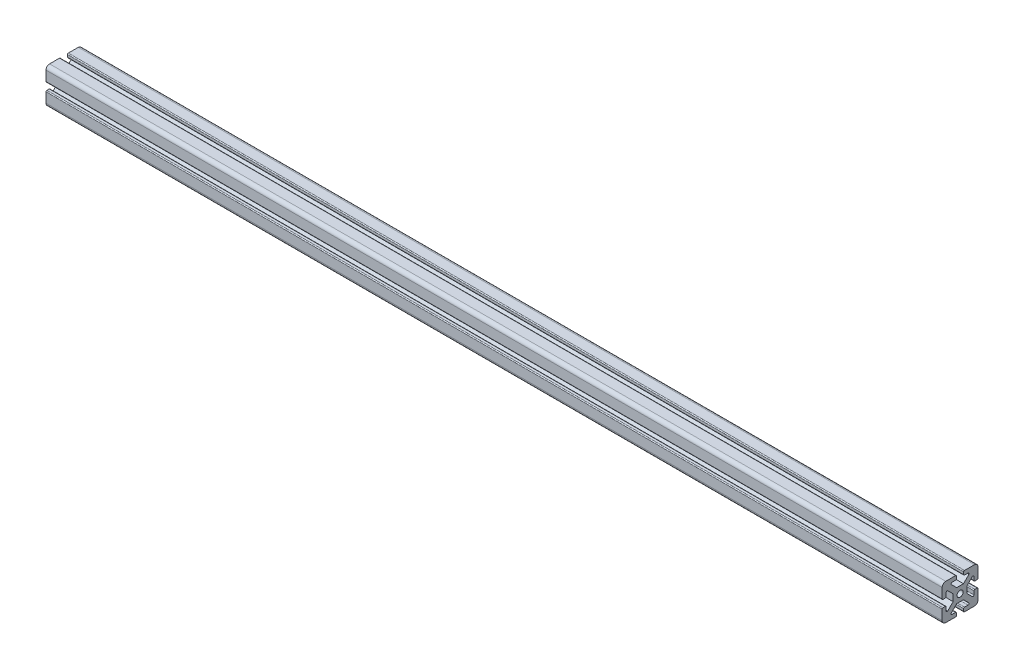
from build123d import *

# Parameters (mm, degrees)
MODEL_R                = 3.4
STRUKTURBAUTEIL1_DEPTH = 1000


with BuildPart() as part:
    # Model → Strukturbauteil1 (new body)
    with BuildSketch(Plane(origin=(0, 0, 0), x_dir=(0, 0, -1), z_dir=(1, 0, 0))):
        with BuildLine():
            Line((-18.5, -4), (-16.5, -4))
            ThreePointArc((-16.5, -4), (-15.792893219, -4.292893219), (-15.5, -5))
            Line((-15.5, -5), (-15.5, -8.91611505))
            ThreePointArc((-15.5, -8.91611505), (-14.905025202, -9.883468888), (-13.773297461, -9.788807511))
            Line((-13.773297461, -9.788807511), (-7.75, -3.793502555))
            Line((-7.75, -3.793502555), (-7.75, 3.793502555))
            Line((-7.75, 3.793502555), (-13.773297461, 9.788807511))
            ThreePointArc((-13.773297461, 9.788807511), (-14.905025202, 9.883468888), (-15.5, 8.91611505))
            Line((-15.5, 8.91611505), (-15.5, 5))
            ThreePointArc((-15.5, 5), (-15.792893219, 4.292893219), (-16.5, 4))
            Line((-16.5, 4), (-18.5, 4))
            Line((-18.5, 4), (-19, 4))
            ThreePointArc((-19, 4), (-19.707106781, 4.292893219), (-20, 5))
            Line((-20, 5), (-20, 16))
            ThreePointArc((-20, 16), (-18.828427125, 18.828427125), (-16, 20))
            Line((-16, 20), (-5.5, 20))
            Line((-5.5, 20), (-5, 20))
            ThreePointArc((-5, 20), (-4.292893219, 19.707106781), (-4, 19))
            Line((-4, 19), (-4, 18.5))
            Line((-4, 18.5), (-4, 16.5))
            ThreePointArc((-4, 16.5), (-4.292893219, 15.792893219), (-5, 15.5))
            Line((-5, 15.5), (-8.91611505, 15.5))
            ThreePointArc((-8.91611505, 15.5), (-9.883468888, 14.905025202), (-9.788807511, 13.773297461))
            Line((-9.788807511, 13.773297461), (-3.793502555, 7.75))
            Line((-3.793502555, 7.75), (3.793502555, 7.75))
            Line((3.793502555, 7.75), (9.788807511, 13.773297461))
            ThreePointArc((9.788807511, 13.773297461), (9.883468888, 14.905025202), (8.91611505, 15.5))
            Line((8.91611505, 15.5), (5, 15.5))
            ThreePointArc((5, 15.5), (4.292893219, 15.792893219), (4, 16.5))
            Line((4, 16.5), (4, 18.5))
            Line((4, 18.5), (4, 19))
            ThreePointArc((4, 19), (4.292893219, 19.707106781), (5, 20))
            Line((5, 20), (5.5, 20))
            Line((5.5, 20), (16, 20))
            ThreePointArc((16, 20), (18.828427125, 18.828427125), (20, 16))
            Line((20, 16), (20, 5.5))
            Line((20, 5.5), (20, 5))
            ThreePointArc((20, 5), (19.707106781, 4.292893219), (19, 4))
            Line((19, 4), (18.5, 4))
            Line((18.5, 4), (16.5, 4))
            ThreePointArc((16.5, 4), (15.792893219, 4.292893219), (15.5, 5))
            Line((15.5, 5), (15.5, 8.91611505))
            ThreePointArc((15.5, 8.91611505), (14.905025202, 9.883468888), (13.773297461, 9.788807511))
            Line((13.773297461, 9.788807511), (7.75, 3.793502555))
            Line((7.75, 3.793502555), (7.75, -3.793502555))
            Line((7.75, -3.793502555), (13.773297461, -9.788807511))
            ThreePointArc((13.773297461, -9.788807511), (14.905025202, -9.883468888), (15.5, -8.91611505))
            Line((15.5, -8.91611505), (15.5, -5))
            ThreePointArc((15.5, -5), (15.792893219, -4.292893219), (16.5, -4))
            Line((16.5, -4), (18.5, -4))
            Line((18.5, -4), (19, -4))
            ThreePointArc((19, -4), (19.707106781, -4.292893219), (20, -5))
            Line((20, -5), (20, -5.5))
            Line((20, -5.5), (20, -16))
            ThreePointArc((20, -16), (18.828427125, -18.828427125), (16, -20))
            Line((16, -20), (5.5, -20))
            Line((5.5, -20), (5, -20))
            ThreePointArc((5, -20), (4.292893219, -19.707106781), (4, -19))
            Line((4, -19), (4, -18.5))
            Line((4, -18.5), (4, -16.5))
            ThreePointArc((4, -16.5), (4.292893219, -15.792893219), (5, -15.5))
            Line((5, -15.5), (8.91611505, -15.5))
            ThreePointArc((8.91611505, -15.5), (9.883468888, -14.905025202), (9.788807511, -13.773297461))
            Line((9.788807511, -13.773297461), (3.793502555, -7.75))
            Line((3.793502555, -7.75), (-3.793502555, -7.75))
            Line((-3.793502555, -7.75), (-9.788807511, -13.773297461))
            ThreePointArc((-9.788807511, -13.773297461), (-9.883468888, -14.905025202), (-8.91611505, -15.5))
            Line((-8.91611505, -15.5), (-5, -15.5))
            ThreePointArc((-5, -15.5), (-4.292893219, -15.792893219), (-4, -16.5))
            Line((-4, -16.5), (-4, -18.5))
            Line((-4, -18.5), (-4, -19))
            ThreePointArc((-4, -19), (-4.292893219, -19.707106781), (-5, -20))
            Line((-5, -20), (-5.5, -20))
            Line((-5.5, -20), (-16, -20))
            ThreePointArc((-16, -20), (-18.828427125, -18.828427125), (-20, -16))
            Line((-20, -16), (-20, -5))
            ThreePointArc((-20, -5), (-19.707106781, -4.292893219), (-19, -4))
            Line((-19, -4), (-18.5, -4))
        make_face()
        Circle(MODEL_R, mode=Mode.SUBTRACT)
    extrude(amount=STRUKTURBAUTEIL1_DEPTH)


solid = part.part
